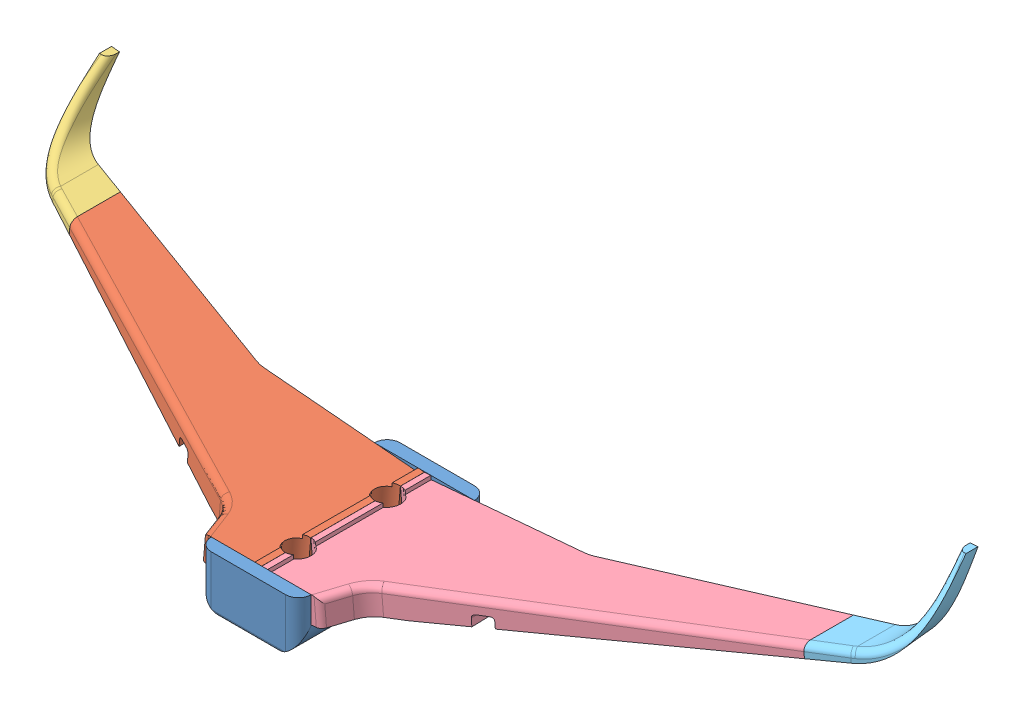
SolidWorks assembly Voilure.SLDASM, configuration Default (file format 8000). Lengths in mm.
Overall size (277.56 46.39 92.69).
6 component instances, 5 part files, 12 mates.
Components (placement in the parent):
- 7-Berceau Voilure-1: 7-Berceau Voilure.SLDPRT [Défaut] at (-15.625 11.6744 5.359) size (31.25 16.6 29.5)
- 7-Berceau Voilure-2: 7-Berceau Voilure.SLDPRT [Défaut] at (15.625 11.6744 64.359) x (-1 0 0) z (0 0 -1) size (31.25 16.6 29.5)
- 9-Voilure Droite-1: 9-Voilure Droite.SLDPRT [Défaut] at (-18.6136 20.3359 60.359) x (0 0 -1) z (0.996195 -0.087156 0) size (70.52 9.36 114.85)
- 11-Winglet droit-2: 11-Winglet droit.SLDPRT [Défaut] at (-18.6136 20.3359 60.359) x (0 0 -1) z (0.996195 -0.087156 0) size (33.82 23.06 34.01)
- 8-Voilure Gauche-3: 8-Voilure Gauche.SLDPRT [Défaut] at (18.6136 20.3359 60.359) x (0 0 -1) z (0.996195 0.087156 0) size (70.52 9.36 114.85)
- 10-Winglet gauche-5: 10-Winglet gauche.SLDPRT [Défaut] at (18.6136 20.3359 60.359) x (0 0 -1) z (0.996195 0.087156 0) size (33.82 23.06 34.01)
Mates (geometry in assembly coordinates):
- Coïncidente1: coincident anti-aligned: plane of 7-Berceau Voilure-1 through (-7.375 19.9244 34.859) normal (0 0 1); plane of 7-Berceau Voilure-2 through (7.375 19.9244 34.859) normal (0 0 -1)
- Coïncidente2: coincident aligned: plane of 7-Berceau Voilure-1 through (15.625 20.0744 9.359) normal (-0.087156 0.996195 0); plane of 7-Berceau Voilure-2 through (0.8306 18.7801 60.359) normal (-0.087156 0.996195 0)
- Coïncidente3: coincident aligned: plane of 7-Berceau Voilure-1 through (-0.8306 18.7801 9.359) normal (0.087156 0.996195 0); plane of 7-Berceau Voilure-2 through (-15.625 20.0744 60.359) normal (0.087156 0.996195 0)
- Coïncidente4: coincident anti-aligned: plane of 7-Berceau Voilure-1 through (-0.8306 18.7801 9.359) normal (0.087156 0.996195 0); plane of 9-Voilure Droite-1 through (-37.1054 21.9537 9.359) normal (-0.087156 -0.996195 0)
- Coïncidente6: coincident anti-aligned: plane of 9-Voilure Droite-1 through (-114.5298 36.9588 5.4776) normal (-0.996195 0.087156 0); plane of 11-Winglet droit-2 through (-123.4828 -65.3745 271.3984) normal (0.996195 -0.087156 0)
- Coïncidente7: coincident anti-aligned: line of 9-Voilure Droite-1 through (-114.5298 36.9588 -10.1578) axis (0 0 1); line of 11-Winglet droit-2 through (-114.5298 36.9588 3.2661) axis (0 0 -1)
- Coïncidente8: coincident anti-aligned: line of 9-Voilure Droite-1 through (-114.5298 36.9588 -10.1578) axis (-0.087156 -0.996195 0); line of 11-Winglet droit-2 through (-114.8426 33.3837 -10.1578) axis (0.087156 0.996195 0)
- Distance2: distance = 15.625 mm aligned: plane of 7-Berceau Voilure-1 through (-15.625 11.6744 5.359) normal (1 0 0); plane of assembly through (0 0 0) normal (1 0 0)
- Coïncidente9: coincident anti-aligned: plane of 7-Berceau Voilure-1 through (15.625 20.0744 9.359) normal (-0.087156 0.996195 0); plane of 8-Voilure Gauche-3 through (37.1054 21.9537 9.359) normal (0.087156 -0.996195 0)
- Coïncidente10: coincident anti-aligned: plane of 8-Voilure Gauche-3 through (114.5298 36.9588 5.4776) normal (0.996195 0.087156 0); plane of 10-Winglet gauche-5 through (123.4828 -65.3745 271.3984) normal (-0.996195 -0.087156 0)
- Coïncidente11: coincident anti-aligned: line of 8-Voilure Gauche-3 through (114.5298 36.9588 -10.1578) axis (0.087156 -0.996195 0); line of 10-Winglet gauche-5 through (114.8426 33.3837 -10.1578) axis (-0.087156 0.996195 0)
- Coïncidente12: coincident anti-aligned: line of 8-Voilure Gauche-3 through (114.5298 36.9588 -10.1578) axis (0 0 1); line of 10-Winglet gauche-5 through (114.5298 36.9588 3.2661) axis (0 0 -1)
